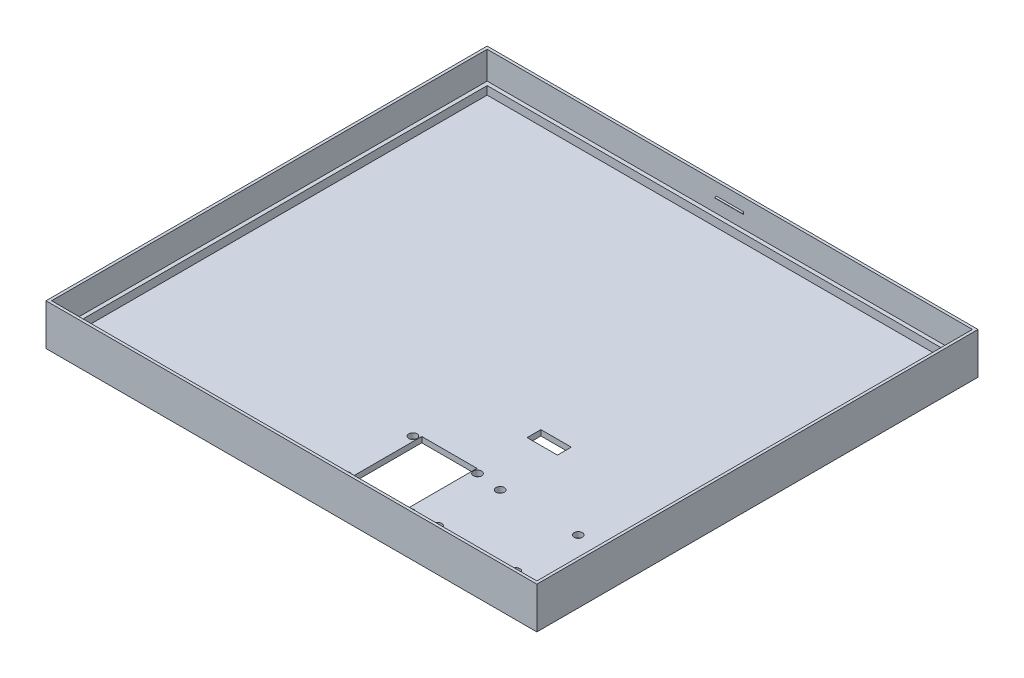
ISO-10303-21;
HEADER;
FILE_DESCRIPTION(('STEP AP214'),'2;1');
FILE_NAME('part.step','',(''),(''),'','','');
FILE_SCHEMA(('AUTOMOTIVE_DESIGN { 1 0 10303 214 1 1 1 1 }'));
ENDSEC;
DATA;
#1=APPLICATION_CONTEXT('core data for automotive mechanical design processes');
#2=APPLICATION_PROTOCOL_DEFINITION('international standard','automotive_design',2000,#1);
#3=PRODUCT_CONTEXT('',#1,'mechanical');
#4=PRODUCT('Part','Part','',(#3));
#5=PRODUCT_RELATED_PRODUCT_CATEGORY('part','',(#4));
#6=PRODUCT_DEFINITION_FORMATION('','',#4);
#7=PRODUCT_DEFINITION_CONTEXT('part definition',#1,'design');
#8=PRODUCT_DEFINITION('design','',#6,#7);
#9=PRODUCT_DEFINITION_SHAPE('','',#8);
#10=(LENGTH_UNIT() NAMED_UNIT(*) SI_UNIT(.MILLI.,.METRE.));
#11=(NAMED_UNIT(*) PLANE_ANGLE_UNIT() SI_UNIT($,.RADIAN.));
#12=(NAMED_UNIT(*) SI_UNIT($,.STERADIAN.) SOLID_ANGLE_UNIT());
#13=UNCERTAINTY_MEASURE_WITH_UNIT(LENGTH_MEASURE(1.E-05),#10,'distance_accuracy_value','');
#14=(GEOMETRIC_REPRESENTATION_CONTEXT(3) GLOBAL_UNCERTAINTY_ASSIGNED_CONTEXT((#13)) GLOBAL_UNIT_ASSIGNED_CONTEXT((#10,
#11,#12)) REPRESENTATION_CONTEXT('',''));
#15=CARTESIAN_POINT('',(0.,0.,0.));
#16=DIRECTION('',(0.,0.,1.));
#17=DIRECTION('',(1.,0.,0.));
#18=AXIS2_PLACEMENT_3D('',#15,#16,#17);
#19=CARTESIAN_POINT('',(0.,0.,0.));
#20=DIRECTION('',(0.,-1.,0.));
#21=DIRECTION('',(0.,0.,-1.));
#22=AXIS2_PLACEMENT_3D('',#19,#20,#21);
#23=PLANE('',#22);
#24=DIRECTION('',(0.,0.,-1.));
#25=VECTOR('',#24,1.);
#26=CARTESIAN_POINT('',(117.060137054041,0.,-62.2095224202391));
#27=LINE('',#26,#25);
#28=CARTESIAN_POINT('',(117.060137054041,0.,-57.2095224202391));
#29=VERTEX_POINT('',#28);
#30=CARTESIAN_POINT('',(117.060137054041,0.,-62.2095224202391));
#31=VERTEX_POINT('',#30);
#32=EDGE_CURVE('E56',#29,#31,#27,.T.);
#33=ORIENTED_EDGE('',*,*,#32,.F.);
#34=DIRECTION('',(-1.,0.,0.));
#35=VECTOR('',#34,1.);
#36=CARTESIAN_POINT('',(117.060137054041,0.,-57.2095224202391));
#37=LINE('',#36,#35);
#38=CARTESIAN_POINT('',(128.060137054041,0.,-57.2095224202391));
#39=VERTEX_POINT('',#38);
#40=EDGE_CURVE('E267',#39,#29,#37,.T.);
#41=ORIENTED_EDGE('',*,*,#40,.F.);
#42=DIRECTION('',(0.,0.,1.));
#43=VECTOR('',#42,1.);
#44=CARTESIAN_POINT('',(128.060137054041,0.,-62.2095224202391));
#45=LINE('',#44,#43);
#46=CARTESIAN_POINT('',(128.060137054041,0.,-62.2095224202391));
#47=VERTEX_POINT('',#46);
#48=EDGE_CURVE('E270',#47,#39,#45,.T.);
#49=ORIENTED_EDGE('',*,*,#48,.F.);
#50=DIRECTION('',(1.,0.,0.));
#51=VECTOR('',#50,1.);
#52=CARTESIAN_POINT('',(117.060137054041,0.,-62.2095224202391));
#53=LINE('',#52,#51);
#54=EDGE_CURVE('E276',#31,#47,#53,.T.);
#55=ORIENTED_EDGE('',*,*,#54,.F.);
#56=EDGE_LOOP('',(#33,#41,#49,#55));
#57=FACE_BOUND('',#56,.T.);
#58=CARTESIAN_POINT('',(128.582102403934,0.,-13.3166105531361));
#59=DIRECTION('',(0.,-1.,0.));
#60=DIRECTION('',(0.,0.,-1.));
#61=AXIS2_PLACEMENT_3D('',#58,#59,#60);
#62=CIRCLE('',#61,1.5);
#63=CARTESIAN_POINT('',(128.582102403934,0.,-14.8166105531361));
#64=VERTEX_POINT('',#63);
#65=EDGE_CURVE('E327',#64,#64,#62,.T.);
#66=ORIENTED_EDGE('',*,*,#65,.F.);
#67=EDGE_LOOP('',(#66));
#68=FACE_BOUND('',#67,.T.);
#69=CARTESIAN_POINT('',(156.882102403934,0.,-35.9166105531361));
#70=DIRECTION('',(0.,-1.,0.));
#71=DIRECTION('',(0.,0.,-1.));
#72=AXIS2_PLACEMENT_3D('',#69,#70,#71);
#73=CIRCLE('',#72,1.5);
#74=CARTESIAN_POINT('',(156.882102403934,0.,-37.4166105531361));
#75=VERTEX_POINT('',#74);
#76=EDGE_CURVE('E320',#75,#75,#73,.T.);
#77=ORIENTED_EDGE('',*,*,#76,.F.);
#78=EDGE_LOOP('',(#77));
#79=FACE_BOUND('',#78,.T.);
#80=CARTESIAN_POINT('',(156.882102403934,0.,-13.3166105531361));
#81=DIRECTION('',(0.,-1.,0.));
#82=DIRECTION('',(0.,0.,-1.));
#83=AXIS2_PLACEMENT_3D('',#80,#81,#82);
#84=CIRCLE('',#83,1.5);
#85=CARTESIAN_POINT('',(156.882102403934,0.,-14.8166105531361));
#86=VERTEX_POINT('',#85);
#87=EDGE_CURVE('E316',#86,#86,#84,.T.);
#88=ORIENTED_EDGE('',*,*,#87,.F.);
#89=EDGE_LOOP('',(#88));
#90=FACE_BOUND('',#89,.T.);
#91=CARTESIAN_POINT('',(128.582102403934,0.,-35.9166105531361));
#92=DIRECTION('',(0.,-1.,0.));
#93=DIRECTION('',(0.,0.,-1.));
#94=AXIS2_PLACEMENT_3D('',#91,#92,#93);
#95=CIRCLE('',#94,1.5);
#96=CARTESIAN_POINT('',(128.582102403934,0.,-37.4166105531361));
#97=VERTEX_POINT('',#96);
#98=EDGE_CURVE('E326',#97,#97,#95,.T.);
#99=ORIENTED_EDGE('',*,*,#98,.F.);
#100=EDGE_LOOP('',(#99));
#101=FACE_BOUND('',#100,.T.);
#102=CARTESIAN_POINT('',(119.329127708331,0.,-12.6808405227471));
#103=DIRECTION('',(0.,-1.,0.));
#104=DIRECTION('',(0.,0.,-1.));
#105=AXIS2_PLACEMENT_3D('',#102,#103,#104);
#106=CIRCLE('',#105,1.5);
#107=CARTESIAN_POINT('',(119.329127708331,0.,-14.1808405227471));
#108=VERTEX_POINT('',#107);
#109=EDGE_CURVE('E338',#108,#108,#106,.T.);
#110=ORIENTED_EDGE('',*,*,#109,.F.);
#111=EDGE_LOOP('',(#110));
#112=FACE_BOUND('',#111,.T.);
#113=CARTESIAN_POINT('',(95.929127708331,0.,-12.6808405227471));
#114=DIRECTION('',(0.,-1.,0.));
#115=DIRECTION('',(0.,0.,-1.));
#116=AXIS2_PLACEMENT_3D('',#113,#114,#115);
#117=CIRCLE('',#116,1.5);
#118=CARTESIAN_POINT('',(95.929127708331,0.,-14.1808405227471));
#119=VERTEX_POINT('',#118);
#120=EDGE_CURVE('E357',#119,#119,#117,.T.);
#121=ORIENTED_EDGE('',*,*,#120,.F.);
#122=EDGE_LOOP('',(#121));
#123=FACE_BOUND('',#122,.T.);
#124=CARTESIAN_POINT('',(119.329127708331,0.,-36.9808405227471));
#125=DIRECTION('',(0.,-1.,0.));
#126=DIRECTION('',(0.,0.,-1.));
#127=AXIS2_PLACEMENT_3D('',#124,#125,#126);
#128=CIRCLE('',#127,1.5);
#129=CARTESIAN_POINT('',(119.329127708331,0.,-38.4808405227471));
#130=VERTEX_POINT('',#129);
#131=EDGE_CURVE('E351',#130,#130,#128,.T.);
#132=ORIENTED_EDGE('',*,*,#131,.F.);
#133=EDGE_LOOP('',(#132));
#134=FACE_BOUND('',#133,.T.);
#135=CARTESIAN_POINT('',(95.929127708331,0.,-36.9808405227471));
#136=DIRECTION('',(0.,-1.,0.));
#137=DIRECTION('',(0.,0.,-1.));
#138=AXIS2_PLACEMENT_3D('',#135,#136,#137);
#139=CIRCLE('',#138,1.5);
#140=CARTESIAN_POINT('',(95.929127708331,0.,-38.4808405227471));
#141=VERTEX_POINT('',#140);
#142=EDGE_CURVE('E345',#141,#141,#139,.T.);
#143=ORIENTED_EDGE('',*,*,#142,.F.);
#144=EDGE_LOOP('',(#143));
#145=FACE_BOUND('',#144,.T.);
#146=DIRECTION('',(1.,0.,0.));
#147=VECTOR('',#146,1.);
#148=CARTESIAN_POINT('',(0.,0.,-38.4808405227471));
#149=LINE('',#148,#147);
#150=CARTESIAN_POINT('',(97.629127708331,0.,-38.4808405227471));
#151=VERTEX_POINT('',#150);
#152=CARTESIAN_POINT('',(117.629127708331,0.,-38.4808405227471));
#153=VERTEX_POINT('',#152);
#154=EDGE_CURVE('E344',#151,#153,#149,.T.);
#155=ORIENTED_EDGE('',*,*,#154,.F.);
#156=DIRECTION('',(0.,0.,-1.));
#157=VECTOR('',#156,1.);
#158=CARTESIAN_POINT('',(97.629127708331,0.,0.));
#159=LINE('',#158,#157);
#160=CARTESIAN_POINT('',(97.629127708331,0.,-11.1808405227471));
#161=VERTEX_POINT('',#160);
#162=EDGE_CURVE('E369',#161,#151,#159,.T.);
#163=ORIENTED_EDGE('',*,*,#162,.F.);
#164=DIRECTION('',(1.,0.,0.));
#165=VECTOR('',#164,1.);
#166=CARTESIAN_POINT('',(0.,0.,-11.1808405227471));
#167=LINE('',#166,#165);
#168=CARTESIAN_POINT('',(117.629127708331,0.,-11.1808405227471));
#169=VERTEX_POINT('',#168);
#170=EDGE_CURVE('E383',#161,#169,#167,.T.);
#171=ORIENTED_EDGE('',*,*,#170,.T.);
#172=DIRECTION('',(0.,0.,1.));
#173=VECTOR('',#172,1.);
#174=CARTESIAN_POINT('',(117.629127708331,0.,0.));
#175=LINE('',#174,#173);
#176=EDGE_CURVE('E380',#153,#169,#175,.T.);
#177=ORIENTED_EDGE('',*,*,#176,.F.);
#178=EDGE_LOOP('',(#155,#163,#171,#177));
#179=FACE_BOUND('',#178,.T.);
#180=DIRECTION('',(0.,0.,1.));
#181=VECTOR('',#180,1.);
#182=CARTESIAN_POINT('',(0.,0.,0.));
#183=LINE('',#182,#181);
#184=CARTESIAN_POINT('',(0.,0.,-159.8));
#185=VERTEX_POINT('',#184);
#186=CARTESIAN_POINT('',(0.,0.,0.));
#187=VERTEX_POINT('',#186);
#188=EDGE_CURVE('E501',#185,#187,#183,.T.);
#189=ORIENTED_EDGE('',*,*,#188,.F.);
#190=DIRECTION('',(-1.,0.,0.));
#191=VECTOR('',#190,1.);
#192=CARTESIAN_POINT('',(0.,0.,-159.8));
#193=LINE('',#192,#191);
#194=CARTESIAN_POINT('',(177.8,0.,-159.8));
#195=VERTEX_POINT('',#194);
#196=EDGE_CURVE('E506',#195,#185,#193,.T.);
#197=ORIENTED_EDGE('',*,*,#196,.F.);
#198=DIRECTION('',(0.,0.,-1.));
#199=VECTOR('',#198,1.);
#200=CARTESIAN_POINT('',(177.8,0.,0.));
#201=LINE('',#200,#199);
#202=CARTESIAN_POINT('',(177.8,0.,0.));
#203=VERTEX_POINT('',#202);
#204=EDGE_CURVE('E517',#203,#195,#201,.T.);
#205=ORIENTED_EDGE('',*,*,#204,.F.);
#206=DIRECTION('',(1.,0.,0.));
#207=VECTOR('',#206,1.);
#208=CARTESIAN_POINT('',(0.,0.,0.));
#209=LINE('',#208,#207);
#210=EDGE_CURVE('E515',#187,#203,#209,.T.);
#211=ORIENTED_EDGE('',*,*,#210,.F.);
#212=EDGE_LOOP('',(#189,#197,#205,#211));
#213=FACE_BOUND('',#212,.T.);
#214=DIRECTION('',(0.,0.,1.));
#215=VECTOR('',#214,1.);
#216=CARTESIAN_POINT('',(166.940434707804,0.,-32.4363356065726));
#217=LINE('',#216,#215);
#218=CARTESIAN_POINT('',(166.940434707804,0.,-32.4363356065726));
#219=VERTEX_POINT('',#218);
#220=CARTESIAN_POINT('',(166.940434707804,0.,-16.4363356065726));
#221=VERTEX_POINT('',#220);
#222=EDGE_CURVE('E289',#219,#221,#217,.T.);
#223=ORIENTED_EDGE('',*,*,#222,.T.);
#224=DIRECTION('',(1.,0.,0.));
#225=VECTOR('',#224,1.);
#226=CARTESIAN_POINT('',(166.940434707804,0.,-16.4363356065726));
#227=LINE('',#226,#225);
#228=CARTESIAN_POINT('',(169.940434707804,0.,-16.4363356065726));
#229=VERTEX_POINT('',#228);
#230=EDGE_CURVE('E282',#221,#229,#227,.T.);
#231=ORIENTED_EDGE('',*,*,#230,.T.);
#232=DIRECTION('',(0.,0.,1.));
#233=VECTOR('',#232,1.);
#234=CARTESIAN_POINT('',(169.940434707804,0.,-32.4363356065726));
#235=LINE('',#234,#233);
#236=CARTESIAN_POINT('',(169.940434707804,0.,-32.4363356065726));
#237=VERTEX_POINT('',#236);
#238=EDGE_CURVE('E300',#237,#229,#235,.T.);
#239=ORIENTED_EDGE('',*,*,#238,.F.);
#240=DIRECTION('',(1.,0.,0.));
#241=VECTOR('',#240,1.);
#242=CARTESIAN_POINT('',(166.940434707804,0.,-32.4363356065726));
#243=LINE('',#242,#241);
#244=EDGE_CURVE('E303',#219,#237,#243,.T.);
#245=ORIENTED_EDGE('',*,*,#244,.F.);
#246=EDGE_LOOP('',(#223,#231,#239,#245));
#247=FACE_BOUND('',#246,.T.);
#248=ADVANCED_FACE('F41',(#57,#68,#79,#90,#101,#112,#123,#134,#145,#179,#213,#247),#23,.T.);
#249=CARTESIAN_POINT('',(0.,2.,0.));
#250=DIRECTION('',(0.,-1.,0.));
#251=DIRECTION('',(0.,0.,-1.));
#252=AXIS2_PLACEMENT_3D('',#249,#250,#251);
#253=PLANE('',#252);
#254=DIRECTION('',(-1.,0.,0.));
#255=VECTOR('',#254,1.);
#256=CARTESIAN_POINT('',(117.060137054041,2.,-57.2095224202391));
#257=LINE('',#256,#255);
#258=CARTESIAN_POINT('',(128.060137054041,2.,-57.2095224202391));
#259=VERTEX_POINT('',#258);
#260=CARTESIAN_POINT('',(117.060137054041,2.,-57.2095224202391));
#261=VERTEX_POINT('',#260);
#262=EDGE_CURVE('E257',#259,#261,#257,.T.);
#263=ORIENTED_EDGE('',*,*,#262,.T.);
#264=DIRECTION('',(0.,0.,-1.));
#265=VECTOR('',#264,1.);
#266=CARTESIAN_POINT('',(117.060137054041,2.,-62.2095224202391));
#267=LINE('',#266,#265);
#268=CARTESIAN_POINT('',(117.060137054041,2.,-62.2095224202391));
#269=VERTEX_POINT('',#268);
#270=EDGE_CURVE('E251',#261,#269,#267,.T.);
#271=ORIENTED_EDGE('',*,*,#270,.T.);
#272=DIRECTION('',(1.,0.,0.));
#273=VECTOR('',#272,1.);
#274=CARTESIAN_POINT('',(117.060137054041,2.,-62.2095224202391));
#275=LINE('',#274,#273);
#276=CARTESIAN_POINT('',(128.060137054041,2.,-62.2095224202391));
#277=VERTEX_POINT('',#276);
#278=EDGE_CURVE('E260',#269,#277,#275,.T.);
#279=ORIENTED_EDGE('',*,*,#278,.T.);
#280=DIRECTION('',(0.,0.,1.));
#281=VECTOR('',#280,1.);
#282=CARTESIAN_POINT('',(128.060137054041,2.,-62.2095224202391));
#283=LINE('',#282,#281);
#284=EDGE_CURVE('E64',#277,#259,#283,.T.);
#285=ORIENTED_EDGE('',*,*,#284,.T.);
#286=EDGE_LOOP('',(#263,#271,#279,#285));
#287=FACE_BOUND('',#286,.T.);
#288=DIRECTION('',(0.,0.,-1.));
#289=VECTOR('',#288,1.);
#290=CARTESIAN_POINT('',(2.4,2.,-2.40000000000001));
#291=LINE('',#290,#289);
#292=CARTESIAN_POINT('',(2.4,2.,-2.40000000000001));
#293=VERTEX_POINT('',#292);
#294=CARTESIAN_POINT('',(2.4,2.,-157.4));
#295=VERTEX_POINT('',#294);
#296=EDGE_CURVE('E478',#293,#295,#291,.T.);
#297=ORIENTED_EDGE('',*,*,#296,.F.);
#298=DIRECTION('',(1.,0.,0.));
#299=VECTOR('',#298,1.);
#300=CARTESIAN_POINT('',(2.4,2.,-2.40000000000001));
#301=LINE('',#300,#299);
#302=CARTESIAN_POINT('',(175.4,2.,-2.40000000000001));
#303=VERTEX_POINT('',#302);
#304=EDGE_CURVE('E486',#293,#303,#301,.T.);
#305=ORIENTED_EDGE('',*,*,#304,.T.);
#306=DIRECTION('',(0.,0.,-1.));
#307=VECTOR('',#306,1.);
#308=CARTESIAN_POINT('',(175.4,2.,-2.40000000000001));
#309=LINE('',#308,#307);
#310=CARTESIAN_POINT('',(175.4,2.,-157.4));
#311=VERTEX_POINT('',#310);
#312=EDGE_CURVE('E483',#303,#311,#309,.T.);
#313=ORIENTED_EDGE('',*,*,#312,.T.);
#314=DIRECTION('',(1.,0.,0.));
#315=VECTOR('',#314,1.);
#316=CARTESIAN_POINT('',(2.4,2.,-157.4));
#317=LINE('',#316,#315);
#318=EDGE_CURVE('E481',#295,#311,#317,.T.);
#319=ORIENTED_EDGE('',*,*,#318,.F.);
#320=EDGE_LOOP('',(#297,#305,#313,#319));
#321=FACE_BOUND('',#320,.T.);
#322=DIRECTION('',(0.,0.,-1.));
#323=VECTOR('',#322,1.);
#324=CARTESIAN_POINT('',(97.629127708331,2.,0.));
#325=LINE('',#324,#323);
#326=CARTESIAN_POINT('',(97.629127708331,2.,-11.1808405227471));
#327=VERTEX_POINT('',#326);
#328=CARTESIAN_POINT('',(97.629127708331,2.,-38.4808405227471));
#329=VERTEX_POINT('',#328);
#330=EDGE_CURVE('E375',#327,#329,#325,.T.);
#331=ORIENTED_EDGE('',*,*,#330,.T.);
#332=DIRECTION('',(1.,0.,0.));
#333=VECTOR('',#332,1.);
#334=CARTESIAN_POINT('',(0.,2.,-38.4808405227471));
#335=LINE('',#334,#333);
#336=CARTESIAN_POINT('',(117.629127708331,2.,-38.4808405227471));
#337=VERTEX_POINT('',#336);
#338=EDGE_CURVE('E365',#329,#337,#335,.T.);
#339=ORIENTED_EDGE('',*,*,#338,.T.);
#340=DIRECTION('',(0.,0.,1.));
#341=VECTOR('',#340,1.);
#342=CARTESIAN_POINT('',(117.629127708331,2.,0.));
#343=LINE('',#342,#341);
#344=CARTESIAN_POINT('',(117.629127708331,2.,-11.1808405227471));
#345=VERTEX_POINT('',#344);
#346=EDGE_CURVE('E368',#337,#345,#343,.T.);
#347=ORIENTED_EDGE('',*,*,#346,.T.);
#348=DIRECTION('',(1.,0.,0.));
#349=VECTOR('',#348,1.);
#350=CARTESIAN_POINT('',(0.,2.,-11.1808405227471));
#351=LINE('',#350,#349);
#352=EDGE_CURVE('E372',#327,#345,#351,.T.);
#353=ORIENTED_EDGE('',*,*,#352,.F.);
#354=EDGE_LOOP('',(#331,#339,#347,#353));
#355=FACE_BOUND('',#354,.T.);
#356=CARTESIAN_POINT('',(95.929127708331,2.,-36.9808405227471));
#357=DIRECTION('',(0.,-1.,0.));
#358=DIRECTION('',(0.,0.,-1.));
#359=AXIS2_PLACEMENT_3D('',#356,#357,#358);
#360=CIRCLE('',#359,1.5);
#361=CARTESIAN_POINT('',(95.929127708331,2.,-38.4808405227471));
#362=VERTEX_POINT('',#361);
#363=EDGE_CURVE('E341',#362,#362,#360,.T.);
#364=ORIENTED_EDGE('',*,*,#363,.T.);
#365=EDGE_LOOP('',(#364));
#366=FACE_BOUND('',#365,.T.);
#367=CARTESIAN_POINT('',(119.329127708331,2.,-36.9808405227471));
#368=DIRECTION('',(0.,-1.,0.));
#369=DIRECTION('',(0.,0.,-1.));
#370=AXIS2_PLACEMENT_3D('',#367,#368,#369);
#371=CIRCLE('',#370,1.5);
#372=CARTESIAN_POINT('',(119.329127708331,2.,-38.4808405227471));
#373=VERTEX_POINT('',#372);
#374=EDGE_CURVE('E348',#373,#373,#371,.T.);
#375=ORIENTED_EDGE('',*,*,#374,.T.);
#376=EDGE_LOOP('',(#375));
#377=FACE_BOUND('',#376,.T.);
#378=CARTESIAN_POINT('',(95.929127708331,2.,-12.6808405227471));
#379=DIRECTION('',(0.,-1.,0.));
#380=DIRECTION('',(0.,0.,-1.));
#381=AXIS2_PLACEMENT_3D('',#378,#379,#380);
#382=CIRCLE('',#381,1.5);
#383=CARTESIAN_POINT('',(95.929127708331,2.,-14.1808405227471));
#384=VERTEX_POINT('',#383);
#385=EDGE_CURVE('E354',#384,#384,#382,.T.);
#386=ORIENTED_EDGE('',*,*,#385,.T.);
#387=EDGE_LOOP('',(#386));
#388=FACE_BOUND('',#387,.T.);
#389=CARTESIAN_POINT('',(119.329127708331,2.,-12.6808405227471));
#390=DIRECTION('',(0.,-1.,0.));
#391=DIRECTION('',(0.,0.,-1.));
#392=AXIS2_PLACEMENT_3D('',#389,#390,#391);
#393=CIRCLE('',#392,1.5);
#394=CARTESIAN_POINT('',(119.329127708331,2.,-14.1808405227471));
#395=VERTEX_POINT('',#394);
#396=EDGE_CURVE('E360',#395,#395,#393,.T.);
#397=ORIENTED_EDGE('',*,*,#396,.T.);
#398=EDGE_LOOP('',(#397));
#399=FACE_BOUND('',#398,.T.);
#400=CARTESIAN_POINT('',(128.582102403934,2.,-35.9166105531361));
#401=DIRECTION('',(0.,-1.,0.));
#402=DIRECTION('',(0.,0.,-1.));
#403=AXIS2_PLACEMENT_3D('',#400,#401,#402);
#404=CIRCLE('',#403,1.5);
#405=CARTESIAN_POINT('',(128.582102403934,2.,-37.4166105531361));
#406=VERTEX_POINT('',#405);
#407=EDGE_CURVE('E335',#406,#406,#404,.T.);
#408=ORIENTED_EDGE('',*,*,#407,.T.);
#409=EDGE_LOOP('',(#408));
#410=FACE_BOUND('',#409,.T.);
#411=CARTESIAN_POINT('',(156.882102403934,2.,-13.3166105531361));
#412=DIRECTION('',(0.,-1.,0.));
#413=DIRECTION('',(0.,0.,-1.));
#414=AXIS2_PLACEMENT_3D('',#411,#412,#413);
#415=CIRCLE('',#414,1.5);
#416=CARTESIAN_POINT('',(156.882102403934,2.,-14.8166105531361));
#417=VERTEX_POINT('',#416);
#418=EDGE_CURVE('E317',#417,#417,#415,.T.);
#419=ORIENTED_EDGE('',*,*,#418,.T.);
#420=EDGE_LOOP('',(#419));
#421=FACE_BOUND('',#420,.T.);
#422=CARTESIAN_POINT('',(156.882102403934,2.,-35.9166105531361));
#423=DIRECTION('',(0.,-1.,0.));
#424=DIRECTION('',(0.,0.,-1.));
#425=AXIS2_PLACEMENT_3D('',#422,#423,#424);
#426=CIRCLE('',#425,1.5);
#427=CARTESIAN_POINT('',(156.882102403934,2.,-37.4166105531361));
#428=VERTEX_POINT('',#427);
#429=EDGE_CURVE('E330',#428,#428,#426,.T.);
#430=ORIENTED_EDGE('',*,*,#429,.T.);
#431=EDGE_LOOP('',(#430));
#432=FACE_BOUND('',#431,.T.);
#433=CARTESIAN_POINT('',(128.582102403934,2.,-13.3166105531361));
#434=DIRECTION('',(0.,-1.,0.));
#435=DIRECTION('',(0.,0.,-1.));
#436=AXIS2_PLACEMENT_3D('',#433,#434,#435);
#437=CIRCLE('',#436,1.5);
#438=CARTESIAN_POINT('',(128.582102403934,2.,-14.8166105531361));
#439=VERTEX_POINT('',#438);
#440=EDGE_CURVE('E323',#439,#439,#437,.T.);
#441=ORIENTED_EDGE('',*,*,#440,.T.);
#442=EDGE_LOOP('',(#441));
#443=FACE_BOUND('',#442,.T.);
#444=DIRECTION('',(1.,0.,0.));
#445=VECTOR('',#444,1.);
#446=CARTESIAN_POINT('',(166.940434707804,2.,-16.4363356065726));
#447=LINE('',#446,#445);
#448=CARTESIAN_POINT('',(166.940434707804,2.,-16.4363356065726));
#449=VERTEX_POINT('',#448);
#450=CARTESIAN_POINT('',(169.940434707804,2.,-16.4363356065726));
#451=VERTEX_POINT('',#450);
#452=EDGE_CURVE('E286',#449,#451,#447,.T.);
#453=ORIENTED_EDGE('',*,*,#452,.F.);
#454=DIRECTION('',(0.,0.,1.));
#455=VECTOR('',#454,1.);
#456=CARTESIAN_POINT('',(166.940434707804,2.,-32.4363356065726));
#457=LINE('',#456,#455);
#458=CARTESIAN_POINT('',(166.940434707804,2.,-32.4363356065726));
#459=VERTEX_POINT('',#458);
#460=EDGE_CURVE('E295',#459,#449,#457,.T.);
#461=ORIENTED_EDGE('',*,*,#460,.F.);
#462=DIRECTION('',(1.,0.,0.));
#463=VECTOR('',#462,1.);
#464=CARTESIAN_POINT('',(166.940434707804,2.,-32.4363356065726));
#465=LINE('',#464,#463);
#466=CARTESIAN_POINT('',(169.940434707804,2.,-32.4363356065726));
#467=VERTEX_POINT('',#466);
#468=EDGE_CURVE('E292',#459,#467,#465,.T.);
#469=ORIENTED_EDGE('',*,*,#468,.T.);
#470=DIRECTION('',(0.,0.,1.));
#471=VECTOR('',#470,1.);
#472=CARTESIAN_POINT('',(169.940434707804,2.,-32.4363356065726));
#473=LINE('',#472,#471);
#474=EDGE_CURVE('E288',#467,#451,#473,.T.);
#475=ORIENTED_EDGE('',*,*,#474,.T.);
#476=EDGE_LOOP('',(#453,#461,#469,#475));
#477=FACE_BOUND('',#476,.T.);
#478=ADVANCED_FACE('F264',(#287,#321,#355,#366,#377,#388,#399,#410,#421,#432,#443,#477),#253,.F.);
#479=CARTESIAN_POINT('',(83.9,10.,-1.29857864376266));
#480=DIRECTION('',(-1.,0.,0.));
#481=DIRECTION('',(0.,0.,1.));
#482=AXIS2_PLACEMENT_3D('',#479,#480,#481);
#483=CYLINDRICAL_SURFACE('',#482,0.1);
#484=DIRECTION('',(-1.,0.,0.));
#485=VECTOR('',#484,1.);
#486=CARTESIAN_POINT('',(83.9,10.0707106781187,-1.36928932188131));
#487=LINE('',#486,#485);
#488=CARTESIAN_POINT('',(93.9,10.0707106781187,-1.36928932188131));
#489=VERTEX_POINT('',#488);
#490=CARTESIAN_POINT('',(83.9,10.0707106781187,-1.36928932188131));
#491=VERTEX_POINT('',#490);
#492=EDGE_CURVE('E543',#489,#491,#487,.T.);
#493=ORIENTED_EDGE('',*,*,#492,.F.);
#494=CARTESIAN_POINT('',(93.9,10.,-1.29857864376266));
#495=DIRECTION('',(1.,0.,0.));
#496=DIRECTION('',(0.,0.,-1.));
#497=AXIS2_PLACEMENT_3D('',#494,#495,#496);
#498=CIRCLE('',#497,0.1);
#499=CARTESIAN_POINT('',(93.9,9.92928932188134,-1.36928932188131));
#500=VERTEX_POINT('',#499);
#501=EDGE_CURVE('E49',#500,#489,#498,.T.);
#502=ORIENTED_EDGE('',*,*,#501,.F.);
#503=DIRECTION('',(-1.,0.,0.));
#504=VECTOR('',#503,1.);
#505=CARTESIAN_POINT('',(83.9,9.92928932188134,-1.36928932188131));
#506=LINE('',#505,#504);
#507=CARTESIAN_POINT('',(83.9,9.92928932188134,-1.36928932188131));
#508=VERTEX_POINT('',#507);
#509=EDGE_CURVE('E546',#508,#500,#506,.F.);
#510=ORIENTED_EDGE('',*,*,#509,.F.);
#511=CARTESIAN_POINT('',(83.9,10.,-1.29857864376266));
#512=DIRECTION('',(1.,0.,0.));
#513=DIRECTION('',(0.,0.,-1.));
#514=AXIS2_PLACEMENT_3D('',#511,#512,#513);
#515=CIRCLE('',#514,0.1);
#516=EDGE_CURVE('E11',#491,#508,#515,.F.);
#517=ORIENTED_EDGE('',*,*,#516,.F.);
#518=EDGE_LOOP('',(#493,#502,#510,#517));
#519=FACE_BOUND('',#518,.T.);
#520=ADVANCED_FACE('F43',(#519),#483,.T.);
#521=CARTESIAN_POINT('',(0.999999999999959,5.,-0.999999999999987));
#522=DIRECTION('',(0.,0.,1.));
#523=DIRECTION('',(1.,0.,0.));
#524=AXIS2_PLACEMENT_3D('',#521,#522,#523);
#525=PLANE('',#524);
#526=DIRECTION('',(1.,0.,0.));
#527=VECTOR('',#526,1.);
#528=CARTESIAN_POINT('',(0.999999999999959,15.,-0.999999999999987));
#529=LINE('',#528,#527);
#530=CARTESIAN_POINT('',(0.999999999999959,15.,-0.999999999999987));
#531=VERTEX_POINT('',#530);
#532=CARTESIAN_POINT('',(176.8,15.,-0.999999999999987));
#533=VERTEX_POINT('',#532);
#534=EDGE_CURVE('E454',#531,#533,#529,.T.);
#535=ORIENTED_EDGE('',*,*,#534,.T.);
#536=DIRECTION('',(0.,1.,0.));
#537=VECTOR('',#536,1.);
#538=CARTESIAN_POINT('',(176.8,5.,-0.999999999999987));
#539=LINE('',#538,#537);
#540=CARTESIAN_POINT('',(176.8,5.,-0.999999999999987));
#541=VERTEX_POINT('',#540);
#542=EDGE_CURVE('E467',#541,#533,#539,.T.);
#543=ORIENTED_EDGE('',*,*,#542,.F.);
#544=DIRECTION('',(1.,0.,0.));
#545=VECTOR('',#544,1.);
#546=CARTESIAN_POINT('',(0.999999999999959,5.,-0.999999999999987));
#547=LINE('',#546,#545);
#548=CARTESIAN_POINT('',(0.999999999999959,5.,-0.999999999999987));
#549=VERTEX_POINT('',#548);
#550=EDGE_CURVE('E442',#549,#541,#547,.T.);
#551=ORIENTED_EDGE('',*,*,#550,.F.);
#552=DIRECTION('',(0.,1.,0.));
#553=VECTOR('',#552,1.);
#554=CARTESIAN_POINT('',(0.999999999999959,5.,-0.999999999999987));
#555=LINE('',#554,#553);
#556=EDGE_CURVE('E452',#549,#531,#555,.T.);
#557=ORIENTED_EDGE('',*,*,#556,.T.);
#558=EDGE_LOOP('',(#535,#543,#551,#557));
#559=FACE_BOUND('',#558,.T.);
#560=DIRECTION('',(0.,-1.,0.));
#561=VECTOR('',#560,1.);
#562=CARTESIAN_POINT('',(83.9,10.,-0.999999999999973));
#563=LINE('',#562,#561);
#564=CARTESIAN_POINT('',(83.9,10.44,-0.999999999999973));
#565=VERTEX_POINT('',#564);
#566=CARTESIAN_POINT('',(83.9,9.56,-0.999999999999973));
#567=VERTEX_POINT('',#566);
#568=EDGE_CURVE('E403',#565,#567,#563,.T.);
#569=ORIENTED_EDGE('',*,*,#568,.T.);
#570=DIRECTION('',(1.,0.,0.));
#571=VECTOR('',#570,1.);
#572=CARTESIAN_POINT('',(83.9,9.56,-0.999999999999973));
#573=LINE('',#572,#571);
#574=CARTESIAN_POINT('',(93.9,9.56,-0.999999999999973));
#575=VERTEX_POINT('',#574);
#576=EDGE_CURVE('E411',#567,#575,#573,.T.);
#577=ORIENTED_EDGE('',*,*,#576,.T.);
#578=DIRECTION('',(0.,-1.,0.));
#579=VECTOR('',#578,1.);
#580=CARTESIAN_POINT('',(93.9,10.,-0.999999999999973));
#581=LINE('',#580,#579);
#582=CARTESIAN_POINT('',(93.9,10.44,-0.999999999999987));
#583=VERTEX_POINT('',#582);
#584=EDGE_CURVE('E390',#583,#575,#581,.T.);
#585=ORIENTED_EDGE('',*,*,#584,.F.);
#586=DIRECTION('',(1.,0.,0.));
#587=VECTOR('',#586,1.);
#588=CARTESIAN_POINT('',(83.9,10.44,-0.999999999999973));
#589=LINE('',#588,#587);
#590=EDGE_CURVE('E414',#565,#583,#589,.T.);
#591=ORIENTED_EDGE('',*,*,#590,.F.);
#592=EDGE_LOOP('',(#569,#577,#585,#591));
#593=FACE_BOUND('',#592,.T.);
#594=ADVANCED_FACE('F562',(#559,#593),#525,.F.);
#595=CARTESIAN_POINT('',(83.9,9.99999999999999,-158.501421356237));
#596=DIRECTION('',(1.,0.,0.));
#597=DIRECTION('',(0.,0.,-1.));
#598=AXIS2_PLACEMENT_3D('',#595,#596,#597);
#599=CYLINDRICAL_SURFACE('',#598,0.1);
#600=DIRECTION('',(1.,0.,0.));
#601=VECTOR('',#600,1.);
#602=CARTESIAN_POINT('',(83.9,10.0707106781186,-158.430710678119));
#603=LINE('',#602,#601);
#604=CARTESIAN_POINT('',(83.9,10.0707106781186,-158.430710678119));
#605=VERTEX_POINT('',#604);
#606=CARTESIAN_POINT('',(93.9,10.0707106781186,-158.430710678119));
#607=VERTEX_POINT('',#606);
#608=EDGE_CURVE('E533',#605,#607,#603,.T.);
#609=ORIENTED_EDGE('',*,*,#608,.F.);
#610=CARTESIAN_POINT('',(83.9,9.99999999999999,-158.501421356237));
#611=DIRECTION('',(1.,0.,0.));
#612=DIRECTION('',(0.,0.,-1.));
#613=AXIS2_PLACEMENT_3D('',#610,#611,#612);
#614=CIRCLE('',#613,0.1);
#615=CARTESIAN_POINT('',(83.9,9.92928932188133,-158.430710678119));
#616=VERTEX_POINT('',#615);
#617=EDGE_CURVE('E539',#616,#605,#614,.F.);
#618=ORIENTED_EDGE('',*,*,#617,.F.);
#619=DIRECTION('',(1.,0.,0.));
#620=VECTOR('',#619,1.);
#621=CARTESIAN_POINT('',(83.9,9.92928932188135,-158.430710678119));
#622=LINE('',#621,#620);
#623=CARTESIAN_POINT('',(93.9,9.92928932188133,-158.430710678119));
#624=VERTEX_POINT('',#623);
#625=EDGE_CURVE('E536',#624,#616,#622,.F.);
#626=ORIENTED_EDGE('',*,*,#625,.F.);
#627=CARTESIAN_POINT('',(93.9,9.99999999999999,-158.501421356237));
#628=DIRECTION('',(1.,0.,0.));
#629=DIRECTION('',(0.,0.,-1.));
#630=AXIS2_PLACEMENT_3D('',#627,#628,#629);
#631=CIRCLE('',#630,0.1);
#632=EDGE_CURVE('E541',#607,#624,#631,.T.);
#633=ORIENTED_EDGE('',*,*,#632,.F.);
#634=EDGE_LOOP('',(#609,#618,#626,#633));
#635=FACE_BOUND('',#634,.T.);
#636=ADVANCED_FACE('F606',(#635),#599,.T.);
#637=CARTESIAN_POINT('',(0.999999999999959,5.,-158.8));
#638=DIRECTION('',(0.,0.,-1.));
#639=DIRECTION('',(-1.,0.,0.));
#640=AXIS2_PLACEMENT_3D('',#637,#638,#639);
#641=PLANE('',#640);
#642=DIRECTION('',(-1.,0.,0.));
#643=VECTOR('',#642,1.);
#644=CARTESIAN_POINT('',(0.999999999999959,15.,-158.8));
#645=LINE('',#644,#643);
#646=CARTESIAN_POINT('',(176.8,15.,-158.8));
#647=VERTEX_POINT('',#646);
#648=CARTESIAN_POINT('',(0.999999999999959,15.,-158.8));
#649=VERTEX_POINT('',#648);
#650=EDGE_CURVE('E443',#647,#649,#645,.T.);
#651=ORIENTED_EDGE('',*,*,#650,.T.);
#652=DIRECTION('',(0.,1.,0.));
#653=VECTOR('',#652,1.);
#654=CARTESIAN_POINT('',(0.999999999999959,5.,-158.8));
#655=LINE('',#654,#653);
#656=CARTESIAN_POINT('',(0.999999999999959,5.,-158.8));
#657=VERTEX_POINT('',#656);
#658=EDGE_CURVE('E462',#657,#649,#655,.T.);
#659=ORIENTED_EDGE('',*,*,#658,.F.);
#660=DIRECTION('',(-1.,0.,0.));
#661=VECTOR('',#660,1.);
#662=CARTESIAN_POINT('',(0.999999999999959,5.,-158.8));
#663=LINE('',#662,#661);
#664=CARTESIAN_POINT('',(176.8,5.,-158.8));
#665=VERTEX_POINT('',#664);
#666=EDGE_CURVE('E449',#665,#657,#663,.T.);
#667=ORIENTED_EDGE('',*,*,#666,.F.);
#668=DIRECTION('',(0.,1.,0.));
#669=VECTOR('',#668,1.);
#670=CARTESIAN_POINT('',(176.8,5.,-158.8));
#671=LINE('',#670,#669);
#672=EDGE_CURVE('E465',#665,#647,#671,.T.);
#673=ORIENTED_EDGE('',*,*,#672,.T.);
#674=EDGE_LOOP('',(#651,#659,#667,#673));
#675=FACE_BOUND('',#674,.T.);
#676=DIRECTION('',(0.,-1.,0.));
#677=VECTOR('',#676,1.);
#678=CARTESIAN_POINT('',(83.9,10.,-158.8));
#679=LINE('',#678,#677);
#680=CARTESIAN_POINT('',(83.9,10.44,-158.8));
#681=VERTEX_POINT('',#680);
#682=CARTESIAN_POINT('',(83.9,9.56,-158.8));
#683=VERTEX_POINT('',#682);
#684=EDGE_CURVE('E425',#681,#683,#679,.T.);
#685=ORIENTED_EDGE('',*,*,#684,.F.);
#686=DIRECTION('',(1.,0.,0.));
#687=VECTOR('',#686,1.);
#688=CARTESIAN_POINT('',(83.9,10.44,-158.8));
#689=LINE('',#688,#687);
#690=CARTESIAN_POINT('',(93.9,10.44,-158.8));
#691=VERTEX_POINT('',#690);
#692=EDGE_CURVE('E432',#681,#691,#689,.T.);
#693=ORIENTED_EDGE('',*,*,#692,.T.);
#694=DIRECTION('',(0.,-1.,0.));
#695=VECTOR('',#694,1.);
#696=CARTESIAN_POINT('',(93.9,10.,-158.8));
#697=LINE('',#696,#695);
#698=CARTESIAN_POINT('',(93.9,9.56,-158.8));
#699=VERTEX_POINT('',#698);
#700=EDGE_CURVE('E417',#691,#699,#697,.T.);
#701=ORIENTED_EDGE('',*,*,#700,.T.);
#702=DIRECTION('',(1.,0.,0.));
#703=VECTOR('',#702,1.);
#704=CARTESIAN_POINT('',(83.9,9.56,-158.8));
#705=LINE('',#704,#703);
#706=EDGE_CURVE('E435',#683,#699,#705,.T.);
#707=ORIENTED_EDGE('',*,*,#706,.F.);
#708=EDGE_LOOP('',(#685,#693,#701,#707));
#709=FACE_BOUND('',#708,.T.);
#710=ADVANCED_FACE('F608',(#675,#709),#641,.F.);
#711=CARTESIAN_POINT('',(0.,15.,0.));
#712=DIRECTION('',(0.,-1.,0.));
#713=DIRECTION('',(0.,0.,-1.));
#714=AXIS2_PLACEMENT_3D('',#711,#712,#713);
#715=PLANE('',#714);
#716=ORIENTED_EDGE('',*,*,#534,.F.);
#717=DIRECTION('',(0.,0.,1.));
#718=VECTOR('',#717,1.);
#719=CARTESIAN_POINT('',(0.999999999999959,15.,-158.8));
#720=LINE('',#719,#718);
#721=EDGE_CURVE('E438',#649,#531,#720,.T.);
#722=ORIENTED_EDGE('',*,*,#721,.F.);
#723=ORIENTED_EDGE('',*,*,#650,.F.);
#724=DIRECTION('',(0.,0.,-1.));
#725=VECTOR('',#724,1.);
#726=CARTESIAN_POINT('',(176.8,15.,-158.8));
#727=LINE('',#726,#725);
#728=EDGE_CURVE('E457',#533,#647,#727,.T.);
#729=ORIENTED_EDGE('',*,*,#728,.F.);
#730=EDGE_LOOP('',(#716,#722,#723,#729));
#731=FACE_BOUND('',#730,.T.);
#732=DIRECTION('',(0.,0.,1.));
#733=VECTOR('',#732,1.);
#734=CARTESIAN_POINT('',(0.,15.,0.));
#735=LINE('',#734,#733);
#736=CARTESIAN_POINT('',(0.,15.,-159.8));
#737=VERTEX_POINT('',#736);
#738=CARTESIAN_POINT('',(0.,15.,0.));
#739=VERTEX_POINT('',#738);
#740=EDGE_CURVE('E502',#737,#739,#735,.T.);
#741=ORIENTED_EDGE('',*,*,#740,.T.);
#742=DIRECTION('',(1.,0.,0.));
#743=VECTOR('',#742,1.);
#744=CARTESIAN_POINT('',(0.,15.,0.));
#745=LINE('',#744,#743);
#746=CARTESIAN_POINT('',(177.8,15.,0.));
#747=VERTEX_POINT('',#746);
#748=EDGE_CURVE('E505',#739,#747,#745,.T.);
#749=ORIENTED_EDGE('',*,*,#748,.T.);
#750=DIRECTION('',(0.,0.,-1.));
#751=VECTOR('',#750,1.);
#752=CARTESIAN_POINT('',(177.8,15.,0.));
#753=LINE('',#752,#751);
#754=CARTESIAN_POINT('',(177.8,15.,-159.8));
#755=VERTEX_POINT('',#754);
#756=EDGE_CURVE('E508',#747,#755,#753,.T.);
#757=ORIENTED_EDGE('',*,*,#756,.T.);
#758=DIRECTION('',(-1.,0.,0.));
#759=VECTOR('',#758,1.);
#760=CARTESIAN_POINT('',(0.,15.,-159.8));
#761=LINE('',#760,#759);
#762=EDGE_CURVE('E510',#755,#737,#761,.T.);
#763=ORIENTED_EDGE('',*,*,#762,.T.);
#764=EDGE_LOOP('',(#741,#749,#757,#763));
#765=FACE_BOUND('',#764,.T.);
#766=ADVANCED_FACE('F588',(#731,#765),#715,.F.);
#767=CARTESIAN_POINT('',(0.,15.,0.));
#768=DIRECTION('',(1.,0.,0.));
#769=DIRECTION('',(0.,0.,-1.));
#770=AXIS2_PLACEMENT_3D('',#767,#768,#769);
#771=PLANE('',#770);
#772=ORIENTED_EDGE('',*,*,#188,.T.);
#773=DIRECTION('',(0.,-1.,0.));
#774=VECTOR('',#773,1.);
#775=CARTESIAN_POINT('',(0.,15.,0.));
#776=LINE('',#775,#774);
#777=EDGE_CURVE('E528',#739,#187,#776,.T.);
#778=ORIENTED_EDGE('',*,*,#777,.F.);
#779=ORIENTED_EDGE('',*,*,#740,.F.);
#780=DIRECTION('',(0.,-1.,0.));
#781=VECTOR('',#780,1.);
#782=CARTESIAN_POINT('',(0.,15.,-159.8));
#783=LINE('',#782,#781);
#784=EDGE_CURVE('E512',#737,#185,#783,.T.);
#785=ORIENTED_EDGE('',*,*,#784,.T.);
#786=EDGE_LOOP('',(#772,#778,#779,#785));
#787=FACE_BOUND('',#786,.T.);
#788=ADVANCED_FACE('F602',(#787),#771,.F.);
#789=CARTESIAN_POINT('',(0.,15.,0.));
#790=DIRECTION('',(0.,0.,-1.));
#791=DIRECTION('',(-1.,0.,0.));
#792=AXIS2_PLACEMENT_3D('',#789,#790,#791);
#793=PLANE('',#792);
#794=ORIENTED_EDGE('',*,*,#210,.T.);
#795=DIRECTION('',(0.,-1.,0.));
#796=VECTOR('',#795,1.);
#797=CARTESIAN_POINT('',(177.8,15.,0.));
#798=LINE('',#797,#796);
#799=EDGE_CURVE('E525',#747,#203,#798,.T.);
#800=ORIENTED_EDGE('',*,*,#799,.F.);
#801=ORIENTED_EDGE('',*,*,#748,.F.);
#802=ORIENTED_EDGE('',*,*,#777,.T.);
#803=EDGE_LOOP('',(#794,#800,#801,#802));
#804=FACE_BOUND('',#803,.T.);
#805=ADVANCED_FACE('F598',(#804),#793,.F.);
#806=CARTESIAN_POINT('',(177.8,15.,0.));
#807=DIRECTION('',(-1.,0.,0.));
#808=DIRECTION('',(0.,0.,1.));
#809=AXIS2_PLACEMENT_3D('',#806,#807,#808);
#810=PLANE('',#809);
#811=ORIENTED_EDGE('',*,*,#204,.T.);
#812=DIRECTION('',(0.,-1.,0.));
#813=VECTOR('',#812,1.);
#814=CARTESIAN_POINT('',(177.8,15.,-159.8));
#815=LINE('',#814,#813);
#816=EDGE_CURVE('E522',#755,#195,#815,.T.);
#817=ORIENTED_EDGE('',*,*,#816,.F.);
#818=ORIENTED_EDGE('',*,*,#756,.F.);
#819=ORIENTED_EDGE('',*,*,#799,.T.);
#820=EDGE_LOOP('',(#811,#817,#818,#819));
#821=FACE_BOUND('',#820,.T.);
#822=ADVANCED_FACE('F594',(#821),#810,.F.);
#823=CARTESIAN_POINT('',(0.,15.,-159.8));
#824=DIRECTION('',(0.,0.,1.));
#825=DIRECTION('',(1.,0.,0.));
#826=AXIS2_PLACEMENT_3D('',#823,#824,#825);
#827=PLANE('',#826);
#828=ORIENTED_EDGE('',*,*,#196,.T.);
#829=ORIENTED_EDGE('',*,*,#784,.F.);
#830=ORIENTED_EDGE('',*,*,#762,.F.);
#831=ORIENTED_EDGE('',*,*,#816,.T.);
#832=EDGE_LOOP('',(#828,#829,#830,#831));
#833=FACE_BOUND('',#832,.T.);
#834=ADVANCED_FACE('F590',(#833),#827,.F.);
#835=CARTESIAN_POINT('',(0.999999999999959,5.,-158.8));
#836=DIRECTION('',(-1.,0.,0.));
#837=DIRECTION('',(0.,0.,1.));
#838=AXIS2_PLACEMENT_3D('',#835,#836,#837);
#839=PLANE('',#838);
#840=ORIENTED_EDGE('',*,*,#721,.T.);
#841=ORIENTED_EDGE('',*,*,#556,.F.);
#842=DIRECTION('',(0.,0.,1.));
#843=VECTOR('',#842,1.);
#844=CARTESIAN_POINT('',(0.999999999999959,5.,-158.8));
#845=LINE('',#844,#843);
#846=EDGE_CURVE('E439',#657,#549,#845,.T.);
#847=ORIENTED_EDGE('',*,*,#846,.F.);
#848=ORIENTED_EDGE('',*,*,#658,.T.);
#849=EDGE_LOOP('',(#840,#841,#847,#848));
#850=FACE_BOUND('',#849,.T.);
#851=ADVANCED_FACE('F593',(#850),#839,.F.);
#852=CARTESIAN_POINT('',(176.8,5.,-158.8));
#853=DIRECTION('',(1.,0.,0.));
#854=DIRECTION('',(0.,0.,-1.));
#855=AXIS2_PLACEMENT_3D('',#852,#853,#854);
#856=PLANE('',#855);
#857=ORIENTED_EDGE('',*,*,#728,.T.);
#858=ORIENTED_EDGE('',*,*,#672,.F.);
#859=DIRECTION('',(0.,0.,-1.));
#860=VECTOR('',#859,1.);
#861=CARTESIAN_POINT('',(176.8,5.,-158.8));
#862=LINE('',#861,#860);
#863=EDGE_CURVE('E446',#541,#665,#862,.T.);
#864=ORIENTED_EDGE('',*,*,#863,.F.);
#865=ORIENTED_EDGE('',*,*,#542,.T.);
#866=EDGE_LOOP('',(#857,#858,#864,#865));
#867=FACE_BOUND('',#866,.T.);
#868=ADVANCED_FACE('F653',(#867),#856,.F.);
#869=CARTESIAN_POINT('',(0.,5.,0.));
#870=DIRECTION('',(0.,1.,0.));
#871=DIRECTION('',(0.,0.,1.));
#872=AXIS2_PLACEMENT_3D('',#869,#870,#871);
#873=PLANE('',#872);
#874=DIRECTION('',(-1.,0.,0.));
#875=VECTOR('',#874,1.);
#876=CARTESIAN_POINT('',(2.4,5.,-157.4));
#877=LINE('',#876,#875);
#878=CARTESIAN_POINT('',(175.4,5.,-157.4));
#879=VERTEX_POINT('',#878);
#880=CARTESIAN_POINT('',(2.4,5.,-157.4));
#881=VERTEX_POINT('',#880);
#882=EDGE_CURVE('E472',#879,#881,#877,.T.);
#883=ORIENTED_EDGE('',*,*,#882,.F.);
#884=DIRECTION('',(0.,0.,1.));
#885=VECTOR('',#884,1.);
#886=CARTESIAN_POINT('',(175.4,5.,-2.40000000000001));
#887=LINE('',#886,#885);
#888=CARTESIAN_POINT('',(175.4,5.,-2.40000000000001));
#889=VERTEX_POINT('',#888);
#890=EDGE_CURVE('E464',#879,#889,#887,.T.);
#891=ORIENTED_EDGE('',*,*,#890,.T.);
#892=DIRECTION('',(-1.,0.,0.));
#893=VECTOR('',#892,1.);
#894=CARTESIAN_POINT('',(2.4,5.,-2.40000000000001));
#895=LINE('',#894,#893);
#896=CARTESIAN_POINT('',(2.4,5.,-2.40000000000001));
#897=VERTEX_POINT('',#896);
#898=EDGE_CURVE('E531',#889,#897,#895,.T.);
#899=ORIENTED_EDGE('',*,*,#898,.T.);
#900=DIRECTION('',(0.,0.,1.));
#901=VECTOR('',#900,1.);
#902=CARTESIAN_POINT('',(2.4,5.,-2.40000000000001));
#903=LINE('',#902,#901);
#904=EDGE_CURVE('E475',#881,#897,#903,.T.);
#905=ORIENTED_EDGE('',*,*,#904,.F.);
#906=EDGE_LOOP('',(#883,#891,#899,#905));
#907=FACE_BOUND('',#906,.T.);
#908=ORIENTED_EDGE('',*,*,#846,.T.);
#909=ORIENTED_EDGE('',*,*,#550,.T.);
#910=ORIENTED_EDGE('',*,*,#863,.T.);
#911=ORIENTED_EDGE('',*,*,#666,.T.);
#912=EDGE_LOOP('',(#908,#909,#910,#911));
#913=FACE_BOUND('',#912,.T.);
#914=ADVANCED_FACE('F650',(#907,#913),#873,.T.);
#915=CARTESIAN_POINT('',(2.4,2.,-2.40000000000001));
#916=DIRECTION('',(0.,0.,1.));
#917=DIRECTION('',(1.,0.,0.));
#918=AXIS2_PLACEMENT_3D('',#915,#916,#917);
#919=PLANE('',#918);
#920=ORIENTED_EDGE('',*,*,#898,.F.);
#921=DIRECTION('',(0.,1.,0.));
#922=VECTOR('',#921,1.);
#923=CARTESIAN_POINT('',(175.4,2.,-2.40000000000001));
#924=LINE('',#923,#922);
#925=EDGE_CURVE('E492',#303,#889,#924,.T.);
#926=ORIENTED_EDGE('',*,*,#925,.F.);
#927=ORIENTED_EDGE('',*,*,#304,.F.);
#928=DIRECTION('',(0.,1.,0.));
#929=VECTOR('',#928,1.);
#930=CARTESIAN_POINT('',(2.4,2.,-2.40000000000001));
#931=LINE('',#930,#929);
#932=EDGE_CURVE('E489',#293,#897,#931,.T.);
#933=ORIENTED_EDGE('',*,*,#932,.T.);
#934=EDGE_LOOP('',(#920,#926,#927,#933));
#935=FACE_BOUND('',#934,.T.);
#936=ADVANCED_FACE('F652',(#935),#919,.F.);
#937=CARTESIAN_POINT('',(175.4,2.,-2.40000000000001));
#938=DIRECTION('',(1.,0.,0.));
#939=DIRECTION('',(0.,0.,-1.));
#940=AXIS2_PLACEMENT_3D('',#937,#938,#939);
#941=PLANE('',#940);
#942=ORIENTED_EDGE('',*,*,#890,.F.);
#943=DIRECTION('',(0.,1.,0.));
#944=VECTOR('',#943,1.);
#945=CARTESIAN_POINT('',(175.4,2.,-157.4));
#946=LINE('',#945,#944);
#947=EDGE_CURVE('E495',#311,#879,#946,.T.);
#948=ORIENTED_EDGE('',*,*,#947,.F.);
#949=ORIENTED_EDGE('',*,*,#312,.F.);
#950=ORIENTED_EDGE('',*,*,#925,.T.);
#951=EDGE_LOOP('',(#942,#948,#949,#950));
#952=FACE_BOUND('',#951,.T.);
#953=ADVANCED_FACE('F664',(#952),#941,.F.);
#954=CARTESIAN_POINT('',(2.4,2.,-157.4));
#955=DIRECTION('',(0.,0.,1.));
#956=DIRECTION('',(1.,0.,0.));
#957=AXIS2_PLACEMENT_3D('',#954,#955,#956);
#958=PLANE('',#957);
#959=ORIENTED_EDGE('',*,*,#947,.T.);
#960=ORIENTED_EDGE('',*,*,#882,.T.);
#961=DIRECTION('',(0.,1.,0.));
#962=VECTOR('',#961,1.);
#963=CARTESIAN_POINT('',(2.4,2.,-157.4));
#964=LINE('',#963,#962);
#965=EDGE_CURVE('E498',#295,#881,#964,.T.);
#966=ORIENTED_EDGE('',*,*,#965,.F.);
#967=ORIENTED_EDGE('',*,*,#318,.T.);
#968=EDGE_LOOP('',(#959,#960,#966,#967));
#969=FACE_BOUND('',#968,.T.);
#970=ADVANCED_FACE('F668',(#969),#958,.T.);
#971=CARTESIAN_POINT('',(2.4,2.,-2.40000000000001));
#972=DIRECTION('',(1.,0.,0.));
#973=DIRECTION('',(0.,0.,-1.));
#974=AXIS2_PLACEMENT_3D('',#971,#972,#973);
#975=PLANE('',#974);
#976=ORIENTED_EDGE('',*,*,#965,.T.);
#977=ORIENTED_EDGE('',*,*,#904,.T.);
#978=ORIENTED_EDGE('',*,*,#932,.F.);
#979=ORIENTED_EDGE('',*,*,#296,.T.);
#980=EDGE_LOOP('',(#976,#977,#978,#979));
#981=FACE_BOUND('',#980,.T.);
#982=ADVANCED_FACE('F649',(#981),#975,.T.);
#983=CARTESIAN_POINT('',(83.9,9.56,-158.8));
#984=DIRECTION('',(0.,0.707106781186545,-0.70710678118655));
#985=DIRECTION('',(0.,0.70710678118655,0.707106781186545));
#986=AXIS2_PLACEMENT_3D('',#983,#984,#985);
#987=PLANE('',#986);
#988=DIRECTION('',(0.,0.70710678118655,0.707106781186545));
#989=VECTOR('',#988,1.);
#990=CARTESIAN_POINT('',(93.9,9.56,-158.8));
#991=LINE('',#990,#989);
#992=EDGE_CURVE('E420',#699,#624,#991,.T.);
#993=ORIENTED_EDGE('',*,*,#992,.T.);
#994=ORIENTED_EDGE('',*,*,#625,.T.);
#995=DIRECTION('',(0.,0.70710678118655,0.707106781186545));
#996=VECTOR('',#995,1.);
#997=CARTESIAN_POINT('',(83.9,9.56,-158.8));
#998=LINE('',#997,#996);
#999=EDGE_CURVE('E427',#683,#616,#998,.T.);
#1000=ORIENTED_EDGE('',*,*,#999,.F.);
#1001=ORIENTED_EDGE('',*,*,#706,.T.);
#1002=EDGE_LOOP('',(#993,#994,#1000,#1001));
#1003=FACE_BOUND('',#1002,.T.);
#1004=ADVANCED_FACE('F632',(#1003),#987,.F.);
#1005=CARTESIAN_POINT('',(83.9,10.44,-158.8));
#1006=DIRECTION('',(0.,-0.70710678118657,-0.707106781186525));
#1007=DIRECTION('',(0.,0.707106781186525,-0.70710678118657));
#1008=AXIS2_PLACEMENT_3D('',#1005,#1006,#1007);
#1009=PLANE('',#1008);
#1010=DIRECTION('',(0.,0.707106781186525,-0.70710678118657));
#1011=VECTOR('',#1010,1.);
#1012=CARTESIAN_POINT('',(83.9,10.44,-158.8));
#1013=LINE('',#1012,#1011);
#1014=EDGE_CURVE('E430',#605,#681,#1013,.T.);
#1015=ORIENTED_EDGE('',*,*,#1014,.F.);
#1016=ORIENTED_EDGE('',*,*,#608,.T.);
#1017=DIRECTION('',(0.,0.707106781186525,-0.70710678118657));
#1018=VECTOR('',#1017,1.);
#1019=CARTESIAN_POINT('',(93.9,10.44,-158.8));
#1020=LINE('',#1019,#1018);
#1021=EDGE_CURVE('E423',#607,#691,#1020,.T.);
#1022=ORIENTED_EDGE('',*,*,#1021,.T.);
#1023=ORIENTED_EDGE('',*,*,#692,.F.);
#1024=EDGE_LOOP('',(#1015,#1016,#1022,#1023));
#1025=FACE_BOUND('',#1024,.T.);
#1026=ADVANCED_FACE('F625',(#1025),#1009,.F.);
#1027=CARTESIAN_POINT('',(83.9,0.,0.));
#1028=DIRECTION('',(1.,0.,0.));
#1029=DIRECTION('',(0.,0.,-1.));
#1030=AXIS2_PLACEMENT_3D('',#1027,#1028,#1029);
#1031=PLANE('',#1030);
#1032=ORIENTED_EDGE('',*,*,#999,.T.);
#1033=ORIENTED_EDGE('',*,*,#617,.T.);
#1034=ORIENTED_EDGE('',*,*,#1014,.T.);
#1035=ORIENTED_EDGE('',*,*,#684,.T.);
#1036=EDGE_LOOP('',(#1032,#1033,#1034,#1035));
#1037=FACE_BOUND('',#1036,.T.);
#1038=ADVANCED_FACE('F628',(#1037),#1031,.F.);
#1039=CARTESIAN_POINT('',(93.9,0.,0.));
#1040=DIRECTION('',(1.,0.,0.));
#1041=DIRECTION('',(0.,0.,-1.));
#1042=AXIS2_PLACEMENT_3D('',#1039,#1040,#1041);
#1043=PLANE('',#1042);
#1044=ORIENTED_EDGE('',*,*,#1021,.F.);
#1045=ORIENTED_EDGE('',*,*,#632,.T.);
#1046=ORIENTED_EDGE('',*,*,#992,.F.);
#1047=ORIENTED_EDGE('',*,*,#700,.F.);
#1048=EDGE_LOOP('',(#1044,#1045,#1046,#1047));
#1049=FACE_BOUND('',#1048,.T.);
#1050=ADVANCED_FACE('F636',(#1049),#1043,.T.);
#1051=CARTESIAN_POINT('',(83.9,10.44,-0.999999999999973));
#1052=DIRECTION('',(0.,0.70710678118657,-0.707106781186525));
#1053=DIRECTION('',(0.,0.707106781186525,0.70710678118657));
#1054=AXIS2_PLACEMENT_3D('',#1051,#1052,#1053);
#1055=PLANE('',#1054);
#1056=DIRECTION('',(0.,0.707106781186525,0.70710678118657));
#1057=VECTOR('',#1056,1.);
#1058=CARTESIAN_POINT('',(93.9,10.44,-0.999999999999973));
#1059=LINE('',#1058,#1057);
#1060=EDGE_CURVE('E398',#489,#583,#1059,.T.);
#1061=ORIENTED_EDGE('',*,*,#1060,.F.);
#1062=ORIENTED_EDGE('',*,*,#492,.T.);
#1063=DIRECTION('',(0.,0.707106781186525,0.70710678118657));
#1064=VECTOR('',#1063,1.);
#1065=CARTESIAN_POINT('',(83.9,10.44,-0.999999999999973));
#1066=LINE('',#1065,#1064);
#1067=EDGE_CURVE('E406',#491,#565,#1066,.T.);
#1068=ORIENTED_EDGE('',*,*,#1067,.T.);
#1069=ORIENTED_EDGE('',*,*,#590,.T.);
#1070=EDGE_LOOP('',(#1061,#1062,#1068,#1069));
#1071=FACE_BOUND('',#1070,.T.);
#1072=ADVANCED_FACE('F557',(#1071),#1055,.T.);
#1073=CARTESIAN_POINT('',(83.9,9.56,-0.999999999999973));
#1074=DIRECTION('',(0.,-0.707106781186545,-0.70710678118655));
#1075=DIRECTION('',(0.,0.70710678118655,-0.707106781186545));
#1076=AXIS2_PLACEMENT_3D('',#1073,#1074,#1075);
#1077=PLANE('',#1076);
#1078=DIRECTION('',(0.,0.70710678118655,-0.707106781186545));
#1079=VECTOR('',#1078,1.);
#1080=CARTESIAN_POINT('',(83.9,9.56,-0.999999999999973));
#1081=LINE('',#1080,#1079);
#1082=EDGE_CURVE('E408',#567,#508,#1081,.T.);
#1083=ORIENTED_EDGE('',*,*,#1082,.T.);
#1084=ORIENTED_EDGE('',*,*,#509,.T.);
#1085=DIRECTION('',(0.,0.70710678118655,-0.707106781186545));
#1086=VECTOR('',#1085,1.);
#1087=CARTESIAN_POINT('',(93.9,9.56,-0.999999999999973));
#1088=LINE('',#1087,#1086);
#1089=EDGE_CURVE('E400',#575,#500,#1088,.T.);
#1090=ORIENTED_EDGE('',*,*,#1089,.F.);
#1091=ORIENTED_EDGE('',*,*,#576,.F.);
#1092=EDGE_LOOP('',(#1083,#1084,#1090,#1091));
#1093=FACE_BOUND('',#1092,.T.);
#1094=ADVANCED_FACE('F564',(#1093),#1077,.T.);
#1095=CARTESIAN_POINT('',(83.9,0.,-159.8));
#1096=DIRECTION('',(1.,0.,0.));
#1097=DIRECTION('',(0.,0.,1.));
#1098=AXIS2_PLACEMENT_3D('',#1095,#1096,#1097);
#1099=PLANE('',#1098);
#1100=ORIENTED_EDGE('',*,*,#1067,.F.);
#1101=ORIENTED_EDGE('',*,*,#516,.T.);
#1102=ORIENTED_EDGE('',*,*,#1082,.F.);
#1103=ORIENTED_EDGE('',*,*,#568,.F.);
#1104=EDGE_LOOP('',(#1100,#1101,#1102,#1103));
#1105=FACE_BOUND('',#1104,.T.);
#1106=ADVANCED_FACE('F567',(#1105),#1099,.F.);
#1107=CARTESIAN_POINT('',(93.9,0.,-159.8));
#1108=DIRECTION('',(1.,0.,0.));
#1109=DIRECTION('',(0.,0.,1.));
#1110=AXIS2_PLACEMENT_3D('',#1107,#1108,#1109);
#1111=PLANE('',#1110);
#1112=ORIENTED_EDGE('',*,*,#1089,.T.);
#1113=ORIENTED_EDGE('',*,*,#501,.T.);
#1114=ORIENTED_EDGE('',*,*,#1060,.T.);
#1115=ORIENTED_EDGE('',*,*,#584,.T.);
#1116=EDGE_LOOP('',(#1112,#1113,#1114,#1115));
#1117=FACE_BOUND('',#1116,.T.);
#1118=ADVANCED_FACE('F550',(#1117),#1111,.T.);
#1119=CARTESIAN_POINT('',(0.,2.,-38.4808405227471));
#1120=DIRECTION('',(0.,0.,-1.));
#1121=DIRECTION('',(-1.,0.,0.));
#1122=AXIS2_PLACEMENT_3D('',#1119,#1120,#1121);
#1123=PLANE('',#1122);
#1124=ORIENTED_EDGE('',*,*,#154,.T.);
#1125=DIRECTION('',(0.,-1.,0.));
#1126=VECTOR('',#1125,1.);
#1127=CARTESIAN_POINT('',(117.629127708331,2.,-38.4808405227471));
#1128=LINE('',#1127,#1126);
#1129=EDGE_CURVE('E378',#337,#153,#1128,.T.);
#1130=ORIENTED_EDGE('',*,*,#1129,.F.);
#1131=ORIENTED_EDGE('',*,*,#338,.F.);
#1132=DIRECTION('',(0.,-1.,0.));
#1133=VECTOR('',#1132,1.);
#1134=CARTESIAN_POINT('',(97.629127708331,2.,-38.4808405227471));
#1135=LINE('',#1134,#1133);
#1136=EDGE_CURVE('E388',#329,#151,#1135,.T.);
#1137=ORIENTED_EDGE('',*,*,#1136,.T.);
#1138=EDGE_LOOP('',(#1124,#1130,#1131,#1137));
#1139=FACE_BOUND('',#1138,.T.);
#1140=ADVANCED_FACE('F574',(#1139),#1123,.F.);
#1141=CARTESIAN_POINT('',(97.629127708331,2.,0.));
#1142=DIRECTION('',(-1.,0.,0.));
#1143=DIRECTION('',(0.,0.,1.));
#1144=AXIS2_PLACEMENT_3D('',#1141,#1142,#1143);
#1145=PLANE('',#1144);
#1146=ORIENTED_EDGE('',*,*,#162,.T.);
#1147=ORIENTED_EDGE('',*,*,#1136,.F.);
#1148=ORIENTED_EDGE('',*,*,#330,.F.);
#1149=DIRECTION('',(0.,-1.,0.));
#1150=VECTOR('',#1149,1.);
#1151=CARTESIAN_POINT('',(97.629127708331,2.,-11.1808405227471));
#1152=LINE('',#1151,#1150);
#1153=EDGE_CURVE('E391',#327,#161,#1152,.T.);
#1154=ORIENTED_EDGE('',*,*,#1153,.T.);
#1155=EDGE_LOOP('',(#1146,#1147,#1148,#1154));
#1156=FACE_BOUND('',#1155,.T.);
#1157=ADVANCED_FACE('F766',(#1156),#1145,.F.);
#1158=CARTESIAN_POINT('',(0.,2.,-11.1808405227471));
#1159=DIRECTION('',(0.,0.,-1.));
#1160=DIRECTION('',(-1.,0.,0.));
#1161=AXIS2_PLACEMENT_3D('',#1158,#1159,#1160);
#1162=PLANE('',#1161);
#1163=ORIENTED_EDGE('',*,*,#170,.F.);
#1164=ORIENTED_EDGE('',*,*,#1153,.F.);
#1165=ORIENTED_EDGE('',*,*,#352,.T.);
#1166=DIRECTION('',(0.,-1.,0.));
#1167=VECTOR('',#1166,1.);
#1168=CARTESIAN_POINT('',(117.629127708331,2.,-11.1808405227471));
#1169=LINE('',#1168,#1167);
#1170=EDGE_CURVE('E393',#345,#169,#1169,.T.);
#1171=ORIENTED_EDGE('',*,*,#1170,.T.);
#1172=EDGE_LOOP('',(#1163,#1164,#1165,#1171));
#1173=FACE_BOUND('',#1172,.T.);
#1174=ADVANCED_FACE('F769',(#1173),#1162,.T.);
#1175=CARTESIAN_POINT('',(117.629127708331,2.,0.));
#1176=DIRECTION('',(1.,0.,0.));
#1177=DIRECTION('',(0.,0.,-1.));
#1178=AXIS2_PLACEMENT_3D('',#1175,#1176,#1177);
#1179=PLANE('',#1178);
#1180=ORIENTED_EDGE('',*,*,#176,.T.);
#1181=ORIENTED_EDGE('',*,*,#1170,.F.);
#1182=ORIENTED_EDGE('',*,*,#346,.F.);
#1183=ORIENTED_EDGE('',*,*,#1129,.T.);
#1184=EDGE_LOOP('',(#1180,#1181,#1182,#1183));
#1185=FACE_BOUND('',#1184,.T.);
#1186=ADVANCED_FACE('F754',(#1185),#1179,.F.);
#1187=CARTESIAN_POINT('',(95.929127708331,2.,-36.9808405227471));
#1188=DIRECTION('',(0.,-1.,0.));
#1189=DIRECTION('',(0.,0.,-1.));
#1190=AXIS2_PLACEMENT_3D('',#1187,#1188,#1189);
#1191=CYLINDRICAL_SURFACE('',#1190,1.5);
#1192=ORIENTED_EDGE('',*,*,#363,.F.);
#1193=EDGE_LOOP('',(#1192));
#1194=FACE_BOUND('',#1193,.T.);
#1195=ORIENTED_EDGE('',*,*,#142,.T.);
#1196=EDGE_LOOP('',(#1195));
#1197=FACE_BOUND('',#1196,.T.);
#1198=ADVANCED_FACE('F750',(#1194,#1197),#1191,.F.);
#1199=CARTESIAN_POINT('',(119.329127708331,2.,-36.9808405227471));
#1200=DIRECTION('',(0.,-1.,0.));
#1201=DIRECTION('',(0.,0.,-1.));
#1202=AXIS2_PLACEMENT_3D('',#1199,#1200,#1201);
#1203=CYLINDRICAL_SURFACE('',#1202,1.5);
#1204=ORIENTED_EDGE('',*,*,#374,.F.);
#1205=EDGE_LOOP('',(#1204));
#1206=FACE_BOUND('',#1205,.T.);
#1207=ORIENTED_EDGE('',*,*,#131,.T.);
#1208=EDGE_LOOP('',(#1207));
#1209=FACE_BOUND('',#1208,.T.);
#1210=ADVANCED_FACE('F753',(#1206,#1209),#1203,.F.);
#1211=CARTESIAN_POINT('',(95.929127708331,2.,-12.6808405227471));
#1212=DIRECTION('',(0.,-1.,0.));
#1213=DIRECTION('',(0.,0.,-1.));
#1214=AXIS2_PLACEMENT_3D('',#1211,#1212,#1213);
#1215=CYLINDRICAL_SURFACE('',#1214,1.5);
#1216=ORIENTED_EDGE('',*,*,#385,.F.);
#1217=EDGE_LOOP('',(#1216));
#1218=FACE_BOUND('',#1217,.T.);
#1219=ORIENTED_EDGE('',*,*,#120,.T.);
#1220=EDGE_LOOP('',(#1219));
#1221=FACE_BOUND('',#1220,.T.);
#1222=ADVANCED_FACE('F758',(#1218,#1221),#1215,.F.);
#1223=CARTESIAN_POINT('',(119.329127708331,2.,-12.6808405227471));
#1224=DIRECTION('',(0.,-1.,0.));
#1225=DIRECTION('',(0.,0.,-1.));
#1226=AXIS2_PLACEMENT_3D('',#1223,#1224,#1225);
#1227=CYLINDRICAL_SURFACE('',#1226,1.5);
#1228=ORIENTED_EDGE('',*,*,#396,.F.);
#1229=EDGE_LOOP('',(#1228));
#1230=FACE_BOUND('',#1229,.T.);
#1231=ORIENTED_EDGE('',*,*,#109,.T.);
#1232=EDGE_LOOP('',(#1231));
#1233=FACE_BOUND('',#1232,.T.);
#1234=ADVANCED_FACE('F748',(#1230,#1233),#1227,.F.);
#1235=CARTESIAN_POINT('',(128.582102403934,2.,-35.9166105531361));
#1236=DIRECTION('',(0.,-1.,0.));
#1237=DIRECTION('',(0.,0.,-1.));
#1238=AXIS2_PLACEMENT_3D('',#1235,#1236,#1237);
#1239=CYLINDRICAL_SURFACE('',#1238,1.5);
#1240=ORIENTED_EDGE('',*,*,#407,.F.);
#1241=EDGE_LOOP('',(#1240));
#1242=FACE_BOUND('',#1241,.T.);
#1243=ORIENTED_EDGE('',*,*,#98,.T.);
#1244=EDGE_LOOP('',(#1243));
#1245=FACE_BOUND('',#1244,.T.);
#1246=ADVANCED_FACE('F738',(#1242,#1245),#1239,.F.);
#1247=CARTESIAN_POINT('',(156.882102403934,2.,-13.3166105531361));
#1248=DIRECTION('',(0.,-1.,0.));
#1249=DIRECTION('',(0.,0.,-1.));
#1250=AXIS2_PLACEMENT_3D('',#1247,#1248,#1249);
#1251=CYLINDRICAL_SURFACE('',#1250,1.5);
#1252=ORIENTED_EDGE('',*,*,#418,.F.);
#1253=EDGE_LOOP('',(#1252));
#1254=FACE_BOUND('',#1253,.T.);
#1255=ORIENTED_EDGE('',*,*,#87,.T.);
#1256=EDGE_LOOP('',(#1255));
#1257=FACE_BOUND('',#1256,.T.);
#1258=ADVANCED_FACE('F734',(#1254,#1257),#1251,.F.);
#1259=CARTESIAN_POINT('',(156.882102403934,2.,-35.9166105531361));
#1260=DIRECTION('',(0.,-1.,0.));
#1261=DIRECTION('',(0.,0.,-1.));
#1262=AXIS2_PLACEMENT_3D('',#1259,#1260,#1261);
#1263=CYLINDRICAL_SURFACE('',#1262,1.5);
#1264=ORIENTED_EDGE('',*,*,#429,.F.);
#1265=EDGE_LOOP('',(#1264));
#1266=FACE_BOUND('',#1265,.T.);
#1267=ORIENTED_EDGE('',*,*,#76,.T.);
#1268=EDGE_LOOP('',(#1267));
#1269=FACE_BOUND('',#1268,.T.);
#1270=ADVANCED_FACE('F737',(#1266,#1269),#1263,.F.);
#1271=CARTESIAN_POINT('',(128.582102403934,2.,-13.3166105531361));
#1272=DIRECTION('',(0.,-1.,0.));
#1273=DIRECTION('',(0.,0.,-1.));
#1274=AXIS2_PLACEMENT_3D('',#1271,#1272,#1273);
#1275=CYLINDRICAL_SURFACE('',#1274,1.5);
#1276=ORIENTED_EDGE('',*,*,#440,.F.);
#1277=EDGE_LOOP('',(#1276));
#1278=FACE_BOUND('',#1277,.T.);
#1279=ORIENTED_EDGE('',*,*,#65,.T.);
#1280=EDGE_LOOP('',(#1279));
#1281=FACE_BOUND('',#1280,.T.);
#1282=ADVANCED_FACE('F733',(#1278,#1281),#1275,.F.);
#1283=CARTESIAN_POINT('',(166.940434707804,2.,-16.4363356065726));
#1284=DIRECTION('',(0.,0.,-1.));
#1285=DIRECTION('',(-1.,0.,0.));
#1286=AXIS2_PLACEMENT_3D('',#1283,#1284,#1285);
#1287=PLANE('',#1286);
#1288=ORIENTED_EDGE('',*,*,#230,.F.);
#1289=DIRECTION('',(0.,-1.,0.));
#1290=VECTOR('',#1289,1.);
#1291=CARTESIAN_POINT('',(166.940434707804,2.,-16.4363356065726));
#1292=LINE('',#1291,#1290);
#1293=EDGE_CURVE('E297',#449,#221,#1292,.T.);
#1294=ORIENTED_EDGE('',*,*,#1293,.F.);
#1295=ORIENTED_EDGE('',*,*,#452,.T.);
#1296=DIRECTION('',(0.,-1.,0.));
#1297=VECTOR('',#1296,1.);
#1298=CARTESIAN_POINT('',(169.940434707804,2.,-16.4363356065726));
#1299=LINE('',#1298,#1297);
#1300=EDGE_CURVE('E314',#451,#229,#1299,.T.);
#1301=ORIENTED_EDGE('',*,*,#1300,.T.);
#1302=EDGE_LOOP('',(#1288,#1294,#1295,#1301));
#1303=FACE_BOUND('',#1302,.T.);
#1304=ADVANCED_FACE('F710',(#1303),#1287,.T.);
#1305=CARTESIAN_POINT('',(169.940434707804,2.,-32.4363356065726));
#1306=DIRECTION('',(1.,0.,0.));
#1307=DIRECTION('',(0.,0.,-1.));
#1308=AXIS2_PLACEMENT_3D('',#1305,#1306,#1307);
#1309=PLANE('',#1308);
#1310=ORIENTED_EDGE('',*,*,#238,.T.);
#1311=ORIENTED_EDGE('',*,*,#1300,.F.);
#1312=ORIENTED_EDGE('',*,*,#474,.F.);
#1313=DIRECTION('',(0.,-1.,0.));
#1314=VECTOR('',#1313,1.);
#1315=CARTESIAN_POINT('',(169.940434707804,2.,-32.4363356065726));
#1316=LINE('',#1315,#1314);
#1317=EDGE_CURVE('E312',#467,#237,#1316,.T.);
#1318=ORIENTED_EDGE('',*,*,#1317,.T.);
#1319=EDGE_LOOP('',(#1310,#1311,#1312,#1318));
#1320=FACE_BOUND('',#1319,.T.);
#1321=ADVANCED_FACE('F712',(#1320),#1309,.F.);
#1322=CARTESIAN_POINT('',(166.940434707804,2.,-32.4363356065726));
#1323=DIRECTION('',(0.,0.,-1.));
#1324=DIRECTION('',(-1.,0.,0.));
#1325=AXIS2_PLACEMENT_3D('',#1322,#1323,#1324);
#1326=PLANE('',#1325);
#1327=ORIENTED_EDGE('',*,*,#244,.T.);
#1328=ORIENTED_EDGE('',*,*,#1317,.F.);
#1329=ORIENTED_EDGE('',*,*,#468,.F.);
#1330=DIRECTION('',(0.,-1.,0.));
#1331=VECTOR('',#1330,1.);
#1332=CARTESIAN_POINT('',(166.940434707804,2.,-32.4363356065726));
#1333=LINE('',#1332,#1331);
#1334=EDGE_CURVE('E310',#459,#219,#1333,.T.);
#1335=ORIENTED_EDGE('',*,*,#1334,.T.);
#1336=EDGE_LOOP('',(#1327,#1328,#1329,#1335));
#1337=FACE_BOUND('',#1336,.T.);
#1338=ADVANCED_FACE('F721',(#1337),#1326,.F.);
#1339=CARTESIAN_POINT('',(166.940434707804,2.,-32.4363356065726));
#1340=DIRECTION('',(1.,0.,0.));
#1341=DIRECTION('',(0.,0.,-1.));
#1342=AXIS2_PLACEMENT_3D('',#1339,#1340,#1341);
#1343=PLANE('',#1342);
#1344=ORIENTED_EDGE('',*,*,#222,.F.);
#1345=ORIENTED_EDGE('',*,*,#1334,.F.);
#1346=ORIENTED_EDGE('',*,*,#460,.T.);
#1347=ORIENTED_EDGE('',*,*,#1293,.T.);
#1348=EDGE_LOOP('',(#1344,#1345,#1346,#1347));
#1349=FACE_BOUND('',#1348,.T.);
#1350=ADVANCED_FACE('F718',(#1349),#1343,.T.);
#1351=CARTESIAN_POINT('',(117.060137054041,2.,-62.2095224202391));
#1352=DIRECTION('',(-1.,0.,0.));
#1353=DIRECTION('',(0.,0.,1.));
#1354=AXIS2_PLACEMENT_3D('',#1351,#1352,#1353);
#1355=PLANE('',#1354);
#1356=ORIENTED_EDGE('',*,*,#32,.T.);
#1357=DIRECTION('',(0.,-1.,0.));
#1358=VECTOR('',#1357,1.);
#1359=CARTESIAN_POINT('',(117.060137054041,2.,-62.2095224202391));
#1360=LINE('',#1359,#1358);
#1361=EDGE_CURVE('E247',#269,#31,#1360,.T.);
#1362=ORIENTED_EDGE('',*,*,#1361,.F.);
#1363=ORIENTED_EDGE('',*,*,#270,.F.);
#1364=DIRECTION('',(0.,-1.,0.));
#1365=VECTOR('',#1364,1.);
#1366=CARTESIAN_POINT('',(117.060137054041,2.,-57.2095224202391));
#1367=LINE('',#1366,#1365);
#1368=EDGE_CURVE('E280',#261,#29,#1367,.T.);
#1369=ORIENTED_EDGE('',*,*,#1368,.T.);
#1370=EDGE_LOOP('',(#1356,#1362,#1363,#1369));
#1371=FACE_BOUND('',#1370,.T.);
#1372=ADVANCED_FACE('F249',(#1371),#1355,.F.);
#1373=CARTESIAN_POINT('',(117.060137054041,2.,-57.2095224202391));
#1374=DIRECTION('',(0.,0.,1.));
#1375=DIRECTION('',(1.,0.,0.));
#1376=AXIS2_PLACEMENT_3D('',#1373,#1374,#1375);
#1377=PLANE('',#1376);
#1378=ORIENTED_EDGE('',*,*,#40,.T.);
#1379=ORIENTED_EDGE('',*,*,#1368,.F.);
#1380=ORIENTED_EDGE('',*,*,#262,.F.);
#1381=DIRECTION('',(0.,-1.,0.));
#1382=VECTOR('',#1381,1.);
#1383=CARTESIAN_POINT('',(128.060137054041,2.,-57.2095224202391));
#1384=LINE('',#1383,#1382);
#1385=EDGE_CURVE('E283',#259,#39,#1384,.T.);
#1386=ORIENTED_EDGE('',*,*,#1385,.T.);
#1387=EDGE_LOOP('',(#1378,#1379,#1380,#1386));
#1388=FACE_BOUND('',#1387,.T.);
#1389=ADVANCED_FACE('F1008',(#1388),#1377,.F.);
#1390=CARTESIAN_POINT('',(128.060137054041,2.,-62.2095224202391));
#1391=DIRECTION('',(1.,0.,0.));
#1392=DIRECTION('',(0.,0.,-1.));
#1393=AXIS2_PLACEMENT_3D('',#1390,#1391,#1392);
#1394=PLANE('',#1393);
#1395=ORIENTED_EDGE('',*,*,#48,.T.);
#1396=ORIENTED_EDGE('',*,*,#1385,.F.);
#1397=ORIENTED_EDGE('',*,*,#284,.F.);
#1398=DIRECTION('',(0.,-1.,0.));
#1399=VECTOR('',#1398,1.);
#1400=CARTESIAN_POINT('',(128.060137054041,2.,-62.2095224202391));
#1401=LINE('',#1400,#1399);
#1402=EDGE_CURVE('E256',#277,#47,#1401,.T.);
#1403=ORIENTED_EDGE('',*,*,#1402,.T.);
#1404=EDGE_LOOP('',(#1395,#1396,#1397,#1403));
#1405=FACE_BOUND('',#1404,.T.);
#1406=ADVANCED_FACE('F1015',(#1405),#1394,.F.);
#1407=CARTESIAN_POINT('',(117.060137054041,2.,-62.2095224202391));
#1408=DIRECTION('',(0.,0.,-1.));
#1409=DIRECTION('',(-1.,0.,0.));
#1410=AXIS2_PLACEMENT_3D('',#1407,#1408,#1409);
#1411=PLANE('',#1410);
#1412=ORIENTED_EDGE('',*,*,#54,.T.);
#1413=ORIENTED_EDGE('',*,*,#1402,.F.);
#1414=ORIENTED_EDGE('',*,*,#278,.F.);
#1415=ORIENTED_EDGE('',*,*,#1361,.T.);
#1416=EDGE_LOOP('',(#1412,#1413,#1414,#1415));
#1417=FACE_BOUND('',#1416,.T.);
#1418=ADVANCED_FACE('F261',(#1417),#1411,.F.);
#1419=CLOSED_SHELL('',(#248,#478,#520,#594,#636,#710,#766,#788,#805,#822,#834,#851,#868,#914,
#936,#953,#970,#982,#1004,#1026,#1038,#1050,#1072,#1094,#1106,#1118,#1140,#1157,#1174,#1186,
#1198,#1210,#1222,#1234,#1246,#1258,#1270,#1282,#1304,#1321,#1338,#1350,#1372,#1389,#1406,#1418));
#1420=MANIFOLD_SOLID_BREP('B2',#1419);
#1421=ADVANCED_BREP_SHAPE_REPRESENTATION('',(#18,#1420),#14);
#1422=SHAPE_DEFINITION_REPRESENTATION(#9,#1421);
ENDSEC;
END-ISO-10303-21;
